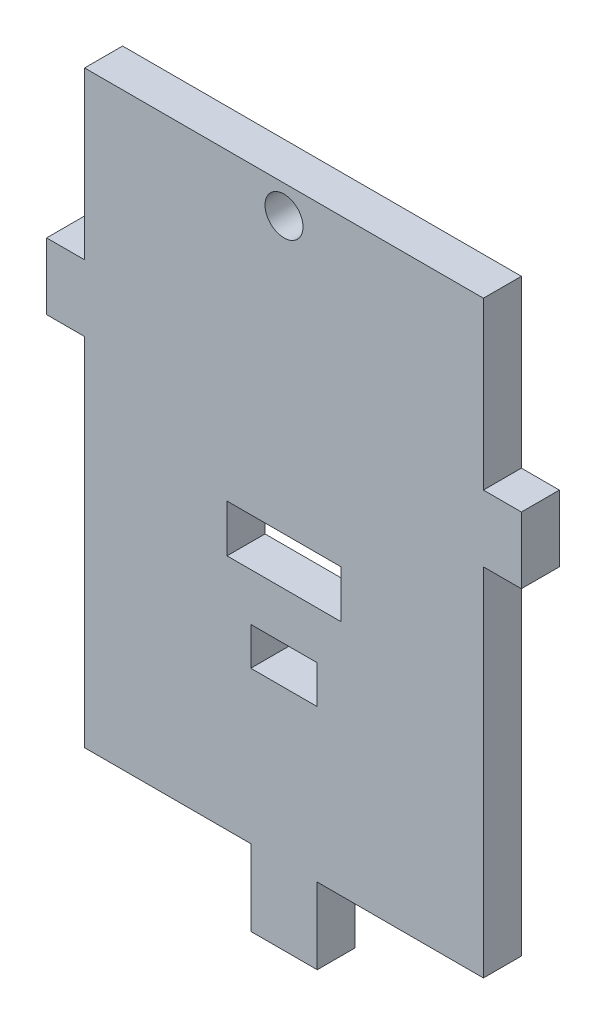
ISO-10303-21;
HEADER;
FILE_DESCRIPTION(('STEP AP214'),'2;1');
FILE_NAME('part.step','',(''),(''),'','','');
FILE_SCHEMA(('AUTOMOTIVE_DESIGN { 1 0 10303 214 1 1 1 1 }'));
ENDSEC;
DATA;
#1=APPLICATION_CONTEXT('core data for automotive mechanical design processes');
#2=APPLICATION_PROTOCOL_DEFINITION('international standard','automotive_design',2000,#1);
#3=PRODUCT_CONTEXT('',#1,'mechanical');
#4=PRODUCT('Part','Part','',(#3));
#5=PRODUCT_RELATED_PRODUCT_CATEGORY('part','',(#4));
#6=PRODUCT_DEFINITION_FORMATION('','',#4);
#7=PRODUCT_DEFINITION_CONTEXT('part definition',#1,'design');
#8=PRODUCT_DEFINITION('design','',#6,#7);
#9=PRODUCT_DEFINITION_SHAPE('','',#8);
#10=(LENGTH_UNIT() NAMED_UNIT(*) SI_UNIT(.MILLI.,.METRE.));
#11=(NAMED_UNIT(*) PLANE_ANGLE_UNIT() SI_UNIT($,.RADIAN.));
#12=(NAMED_UNIT(*) SI_UNIT($,.STERADIAN.) SOLID_ANGLE_UNIT());
#13=UNCERTAINTY_MEASURE_WITH_UNIT(LENGTH_MEASURE(1.E-05),#10,'distance_accuracy_value','');
#14=(GEOMETRIC_REPRESENTATION_CONTEXT(3) GLOBAL_UNCERTAINTY_ASSIGNED_CONTEXT((#13)) GLOBAL_UNIT_ASSIGNED_CONTEXT((#10,
#11,#12)) REPRESENTATION_CONTEXT('',''));
#15=CARTESIAN_POINT('',(0.,0.,0.));
#16=DIRECTION('',(0.,0.,1.));
#17=DIRECTION('',(1.,0.,0.));
#18=AXIS2_PLACEMENT_3D('',#15,#16,#17);
#19=CARTESIAN_POINT('',(0.,-63.3647060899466,4.));
#20=DIRECTION('',(0.,1.,0.));
#21=DIRECTION('',(0.,0.,1.));
#22=AXIS2_PLACEMENT_3D('',#19,#20,#21);
#23=PLANE('',#22);
#24=DIRECTION('',(1.,0.,0.));
#25=VECTOR('',#24,1.);
#26=CARTESIAN_POINT('',(0.,-63.3647060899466,0.));
#27=LINE('',#26,#25);
#28=CARTESIAN_POINT('',(-2.04888623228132,-63.3647060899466,0.));
#29=VERTEX_POINT('',#28);
#30=CARTESIAN_POINT('',(4.95111376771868,-63.3647060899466,0.));
#31=VERTEX_POINT('',#30);
#32=EDGE_CURVE('E289',#29,#31,#27,.T.);
#33=ORIENTED_EDGE('',*,*,#32,.T.);
#34=DIRECTION('',(0.,0.,-1.));
#35=VECTOR('',#34,1.);
#36=CARTESIAN_POINT('',(4.95111376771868,-63.3647060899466,4.));
#37=LINE('',#36,#35);
#38=CARTESIAN_POINT('',(4.95111376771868,-63.3647060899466,4.));
#39=VERTEX_POINT('',#38);
#40=EDGE_CURVE('E293',#39,#31,#37,.T.);
#41=ORIENTED_EDGE('',*,*,#40,.F.);
#42=DIRECTION('',(1.,0.,0.));
#43=VECTOR('',#42,1.);
#44=CARTESIAN_POINT('',(0.,-63.3647060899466,4.));
#45=LINE('',#44,#43);
#46=CARTESIAN_POINT('',(-2.04888623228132,-63.3647060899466,4.));
#47=VERTEX_POINT('',#46);
#48=EDGE_CURVE('E236',#47,#39,#45,.T.);
#49=ORIENTED_EDGE('',*,*,#48,.F.);
#50=DIRECTION('',(0.,0.,-1.));
#51=VECTOR('',#50,1.);
#52=CARTESIAN_POINT('',(-2.04888623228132,-63.3647060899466,4.));
#53=LINE('',#52,#51);
#54=EDGE_CURVE('E296',#47,#29,#53,.T.);
#55=ORIENTED_EDGE('',*,*,#54,.T.);
#56=EDGE_LOOP('',(#33,#41,#49,#55));
#57=FACE_BOUND('',#56,.T.);
#58=ADVANCED_FACE('F106',(#57),#23,.F.);
#59=CARTESIAN_POINT('',(-2.04888623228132,0.,4.));
#60=DIRECTION('',(1.,0.,0.));
#61=DIRECTION('',(0.,0.,-1.));
#62=AXIS2_PLACEMENT_3D('',#59,#60,#61);
#63=PLANE('',#62);
#64=DIRECTION('',(0.,-1.,0.));
#65=VECTOR('',#64,1.);
#66=CARTESIAN_POINT('',(-2.04888623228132,0.,0.));
#67=LINE('',#66,#65);
#68=CARTESIAN_POINT('',(-2.04888623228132,-55.3647060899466,0.));
#69=VERTEX_POINT('',#68);
#70=EDGE_CURVE('E286',#69,#29,#67,.T.);
#71=ORIENTED_EDGE('',*,*,#70,.T.);
#72=ORIENTED_EDGE('',*,*,#54,.F.);
#73=DIRECTION('',(0.,-1.,0.));
#74=VECTOR('',#73,1.);
#75=CARTESIAN_POINT('',(-2.04888623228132,0.,4.));
#76=LINE('',#75,#74);
#77=CARTESIAN_POINT('',(-2.04888623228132,-55.3647060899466,4.));
#78=VERTEX_POINT('',#77);
#79=EDGE_CURVE('E233',#78,#47,#76,.T.);
#80=ORIENTED_EDGE('',*,*,#79,.F.);
#81=DIRECTION('',(0.,0.,-1.));
#82=VECTOR('',#81,1.);
#83=CARTESIAN_POINT('',(-2.04888623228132,-55.3647060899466,4.));
#84=LINE('',#83,#82);
#85=EDGE_CURVE('E300',#78,#69,#84,.T.);
#86=ORIENTED_EDGE('',*,*,#85,.T.);
#87=EDGE_LOOP('',(#71,#72,#80,#86));
#88=FACE_BOUND('',#87,.T.);
#89=ADVANCED_FACE('F456',(#88),#63,.F.);
#90=CARTESIAN_POINT('',(4.95111376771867,0.,4.));
#91=DIRECTION('',(1.,0.,0.));
#92=DIRECTION('',(0.,1.,0.));
#93=AXIS2_PLACEMENT_3D('',#90,#91,#92);
#94=PLANE('',#93);
#95=DIRECTION('',(0.,-1.,0.));
#96=VECTOR('',#95,1.);
#97=CARTESIAN_POINT('',(4.95111376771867,0.,0.));
#98=LINE('',#97,#96);
#99=CARTESIAN_POINT('',(4.95111376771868,-55.3647060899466,0.));
#100=VERTEX_POINT('',#99);
#101=EDGE_CURVE('E268',#100,#31,#98,.T.);
#102=ORIENTED_EDGE('',*,*,#101,.F.);
#103=DIRECTION('',(0.,0.,-1.));
#104=VECTOR('',#103,1.);
#105=CARTESIAN_POINT('',(4.95111376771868,-55.3647060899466,4.));
#106=LINE('',#105,#104);
#107=CARTESIAN_POINT('',(4.95111376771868,-55.3647060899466,4.));
#108=VERTEX_POINT('',#107);
#109=EDGE_CURVE('E199',#108,#100,#106,.T.);
#110=ORIENTED_EDGE('',*,*,#109,.F.);
#111=DIRECTION('',(0.,-1.,0.));
#112=VECTOR('',#111,1.);
#113=CARTESIAN_POINT('',(4.95111376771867,0.,4.));
#114=LINE('',#113,#112);
#115=EDGE_CURVE('E220',#108,#39,#114,.T.);
#116=ORIENTED_EDGE('',*,*,#115,.T.);
#117=ORIENTED_EDGE('',*,*,#40,.T.);
#118=EDGE_LOOP('',(#102,#110,#116,#117));
#119=FACE_BOUND('',#118,.T.);
#120=ADVANCED_FACE('F462',(#119),#94,.T.);
#121=CARTESIAN_POINT('',(-2.04888623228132,0.,4.));
#122=DIRECTION('',(1.,0.,0.));
#123=DIRECTION('',(0.,0.,-1.));
#124=AXIS2_PLACEMENT_3D('',#121,#122,#123);
#125=PLANE('',#124);
#126=DIRECTION('',(0.,-1.,0.));
#127=VECTOR('',#126,1.);
#128=CARTESIAN_POINT('',(-2.04888623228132,0.,0.));
#129=LINE('',#128,#127);
#130=CARTESIAN_POINT('',(-2.04888623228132,-35.3647060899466,0.));
#131=VERTEX_POINT('',#130);
#132=CARTESIAN_POINT('',(-2.04888623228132,-39.3647060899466,0.));
#133=VERTEX_POINT('',#132);
#134=EDGE_CURVE('E265',#131,#133,#129,.T.);
#135=ORIENTED_EDGE('',*,*,#134,.F.);
#136=DIRECTION('',(0.,0.,-1.));
#137=VECTOR('',#136,1.);
#138=CARTESIAN_POINT('',(-2.04888623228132,-35.3647060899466,4.));
#139=LINE('',#138,#137);
#140=CARTESIAN_POINT('',(-2.04888623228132,-35.3647060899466,4.));
#141=VERTEX_POINT('',#140);
#142=EDGE_CURVE('E316',#141,#131,#139,.T.);
#143=ORIENTED_EDGE('',*,*,#142,.F.);
#144=DIRECTION('',(0.,-1.,0.));
#145=VECTOR('',#144,1.);
#146=CARTESIAN_POINT('',(-2.04888623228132,0.,4.));
#147=LINE('',#146,#145);
#148=CARTESIAN_POINT('',(-2.04888623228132,-39.3647060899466,4.));
#149=VERTEX_POINT('',#148);
#150=EDGE_CURVE('E706',#141,#149,#147,.T.);
#151=ORIENTED_EDGE('',*,*,#150,.T.);
#152=DIRECTION('',(0.,0.,-1.));
#153=VECTOR('',#152,1.);
#154=CARTESIAN_POINT('',(-2.04888623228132,-39.3647060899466,4.));
#155=LINE('',#154,#153);
#156=EDGE_CURVE('E319',#149,#133,#155,.T.);
#157=ORIENTED_EDGE('',*,*,#156,.T.);
#158=EDGE_LOOP('',(#135,#143,#151,#157));
#159=FACE_BOUND('',#158,.T.);
#160=ADVANCED_FACE('F488',(#159),#125,.T.);
#161=CARTESIAN_POINT('',(0.,-39.3647060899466,4.));
#162=DIRECTION('',(0.,1.,0.));
#163=DIRECTION('',(0.,0.,1.));
#164=AXIS2_PLACEMENT_3D('',#161,#162,#163);
#165=PLANE('',#164);
#166=DIRECTION('',(1.,0.,0.));
#167=VECTOR('',#166,1.);
#168=CARTESIAN_POINT('',(0.,-39.3647060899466,0.));
#169=LINE('',#168,#167);
#170=CARTESIAN_POINT('',(4.95111376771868,-39.3647060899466,0.));
#171=VERTEX_POINT('',#170);
#172=EDGE_CURVE('E262',#133,#171,#169,.T.);
#173=ORIENTED_EDGE('',*,*,#172,.F.);
#174=ORIENTED_EDGE('',*,*,#156,.F.);
#175=DIRECTION('',(1.,0.,0.));
#176=VECTOR('',#175,1.);
#177=CARTESIAN_POINT('',(0.,-39.3647060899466,4.));
#178=LINE('',#177,#176);
#179=CARTESIAN_POINT('',(4.95111376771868,-39.3647060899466,4.));
#180=VERTEX_POINT('',#179);
#181=EDGE_CURVE('E711',#149,#180,#178,.T.);
#182=ORIENTED_EDGE('',*,*,#181,.T.);
#183=DIRECTION('',(0.,0.,-1.));
#184=VECTOR('',#183,1.);
#185=CARTESIAN_POINT('',(4.95111376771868,-39.3647060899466,4.));
#186=LINE('',#185,#184);
#187=EDGE_CURVE('E323',#180,#171,#186,.T.);
#188=ORIENTED_EDGE('',*,*,#187,.T.);
#189=EDGE_LOOP('',(#173,#174,#182,#188));
#190=FACE_BOUND('',#189,.T.);
#191=ADVANCED_FACE('F492',(#190),#165,.T.);
#192=CARTESIAN_POINT('',(4.95111376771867,0.,4.));
#193=DIRECTION('',(1.,0.,0.));
#194=DIRECTION('',(0.,1.,0.));
#195=AXIS2_PLACEMENT_3D('',#192,#193,#194);
#196=PLANE('',#195);
#197=DIRECTION('',(0.,-1.,0.));
#198=VECTOR('',#197,1.);
#199=CARTESIAN_POINT('',(4.95111376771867,0.,0.));
#200=LINE('',#199,#198);
#201=CARTESIAN_POINT('',(4.95111376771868,-35.3647060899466,0.));
#202=VERTEX_POINT('',#201);
#203=EDGE_CURVE('E259',#202,#171,#200,.T.);
#204=ORIENTED_EDGE('',*,*,#203,.T.);
#205=ORIENTED_EDGE('',*,*,#187,.F.);
#206=DIRECTION('',(0.,-1.,0.));
#207=VECTOR('',#206,1.);
#208=CARTESIAN_POINT('',(4.95111376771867,0.,4.));
#209=LINE('',#208,#207);
#210=CARTESIAN_POINT('',(4.95111376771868,-35.3647060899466,4.));
#211=VERTEX_POINT('',#210);
#212=EDGE_CURVE('E715',#211,#180,#209,.T.);
#213=ORIENTED_EDGE('',*,*,#212,.F.);
#214=DIRECTION('',(0.,0.,-1.));
#215=VECTOR('',#214,1.);
#216=CARTESIAN_POINT('',(4.95111376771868,-35.3647060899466,4.));
#217=LINE('',#216,#215);
#218=EDGE_CURVE('E297',#211,#202,#217,.T.);
#219=ORIENTED_EDGE('',*,*,#218,.T.);
#220=EDGE_LOOP('',(#204,#205,#213,#219));
#221=FACE_BOUND('',#220,.T.);
#222=ADVANCED_FACE('F496',(#221),#196,.F.);
#223=CARTESIAN_POINT('',(0.,-35.3647060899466,4.));
#224=DIRECTION('',(0.,1.,0.));
#225=DIRECTION('',(0.,0.,1.));
#226=AXIS2_PLACEMENT_3D('',#223,#224,#225);
#227=PLANE('',#226);
#228=DIRECTION('',(1.,0.,0.));
#229=VECTOR('',#228,1.);
#230=CARTESIAN_POINT('',(0.,-35.3647060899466,0.));
#231=LINE('',#230,#229);
#232=EDGE_CURVE('E256',#131,#202,#231,.T.);
#233=ORIENTED_EDGE('',*,*,#232,.T.);
#234=ORIENTED_EDGE('',*,*,#218,.F.);
#235=DIRECTION('',(1.,0.,0.));
#236=VECTOR('',#235,1.);
#237=CARTESIAN_POINT('',(0.,-35.3647060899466,4.));
#238=LINE('',#237,#236);
#239=EDGE_CURVE('E717',#141,#211,#238,.T.);
#240=ORIENTED_EDGE('',*,*,#239,.F.);
#241=ORIENTED_EDGE('',*,*,#142,.T.);
#242=EDGE_LOOP('',(#233,#234,#240,#241));
#243=FACE_BOUND('',#242,.T.);
#244=ADVANCED_FACE('F500',(#243),#227,.F.);
#245=CARTESIAN_POINT('',(-4.54888623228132,0.,4.));
#246=DIRECTION('',(1.,0.,0.));
#247=DIRECTION('',(0.,0.,-1.));
#248=AXIS2_PLACEMENT_3D('',#245,#246,#247);
#249=PLANE('',#248);
#250=DIRECTION('',(0.,-1.,0.));
#251=VECTOR('',#250,1.);
#252=CARTESIAN_POINT('',(-4.54888623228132,0.,0.));
#253=LINE('',#252,#251);
#254=CARTESIAN_POINT('',(-4.54888623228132,-25.3647060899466,0.));
#255=VERTEX_POINT('',#254);
#256=CARTESIAN_POINT('',(-4.54888623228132,-30.3647060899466,0.));
#257=VERTEX_POINT('',#256);
#258=EDGE_CURVE('E253',#255,#257,#253,.T.);
#259=ORIENTED_EDGE('',*,*,#258,.F.);
#260=DIRECTION('',(0.,0.,-1.));
#261=VECTOR('',#260,1.);
#262=CARTESIAN_POINT('',(-4.54888623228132,-25.3647060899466,4.));
#263=LINE('',#262,#261);
#264=CARTESIAN_POINT('',(-4.54888623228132,-25.3647060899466,4.));
#265=VERTEX_POINT('',#264);
#266=EDGE_CURVE('E239',#265,#255,#263,.T.);
#267=ORIENTED_EDGE('',*,*,#266,.F.);
#268=DIRECTION('',(0.,-1.,0.));
#269=VECTOR('',#268,1.);
#270=CARTESIAN_POINT('',(-4.54888623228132,0.,4.));
#271=LINE('',#270,#269);
#272=CARTESIAN_POINT('',(-4.54888623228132,-30.3647060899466,4.));
#273=VERTEX_POINT('',#272);
#274=EDGE_CURVE('E739',#265,#273,#271,.T.);
#275=ORIENTED_EDGE('',*,*,#274,.T.);
#276=DIRECTION('',(0.,0.,-1.));
#277=VECTOR('',#276,1.);
#278=CARTESIAN_POINT('',(-4.54888623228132,-30.3647060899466,4.));
#279=LINE('',#278,#277);
#280=EDGE_CURVE('E330',#273,#257,#279,.T.);
#281=ORIENTED_EDGE('',*,*,#280,.T.);
#282=EDGE_LOOP('',(#259,#267,#275,#281));
#283=FACE_BOUND('',#282,.T.);
#284=ADVANCED_FACE('F504',(#283),#249,.T.);
#285=CARTESIAN_POINT('',(0.,-30.3647060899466,4.));
#286=DIRECTION('',(0.,1.,0.));
#287=DIRECTION('',(0.,0.,1.));
#288=AXIS2_PLACEMENT_3D('',#285,#286,#287);
#289=PLANE('',#288);
#290=DIRECTION('',(1.,0.,0.));
#291=VECTOR('',#290,1.);
#292=CARTESIAN_POINT('',(0.,-30.3647060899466,0.));
#293=LINE('',#292,#291);
#294=CARTESIAN_POINT('',(7.45111376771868,-30.3647060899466,0.));
#295=VERTEX_POINT('',#294);
#296=EDGE_CURVE('E250',#257,#295,#293,.T.);
#297=ORIENTED_EDGE('',*,*,#296,.F.);
#298=ORIENTED_EDGE('',*,*,#280,.F.);
#299=DIRECTION('',(1.,0.,0.));
#300=VECTOR('',#299,1.);
#301=CARTESIAN_POINT('',(0.,-30.3647060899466,4.));
#302=LINE('',#301,#300);
#303=CARTESIAN_POINT('',(7.45111376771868,-30.3647060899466,4.));
#304=VERTEX_POINT('',#303);
#305=EDGE_CURVE('E742',#273,#304,#302,.T.);
#306=ORIENTED_EDGE('',*,*,#305,.T.);
#307=DIRECTION('',(0.,0.,-1.));
#308=VECTOR('',#307,1.);
#309=CARTESIAN_POINT('',(7.45111376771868,-30.3647060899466,4.));
#310=LINE('',#309,#308);
#311=EDGE_CURVE('E333',#304,#295,#310,.T.);
#312=ORIENTED_EDGE('',*,*,#311,.T.);
#313=EDGE_LOOP('',(#297,#298,#306,#312));
#314=FACE_BOUND('',#313,.T.);
#315=ADVANCED_FACE('F508',(#314),#289,.T.);
#316=CARTESIAN_POINT('',(7.45111376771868,0.,4.));
#317=DIRECTION('',(1.,0.,0.));
#318=DIRECTION('',(0.,0.,-1.));
#319=AXIS2_PLACEMENT_3D('',#316,#317,#318);
#320=PLANE('',#319);
#321=DIRECTION('',(0.,-1.,0.));
#322=VECTOR('',#321,1.);
#323=CARTESIAN_POINT('',(7.45111376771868,0.,0.));
#324=LINE('',#323,#322);
#325=CARTESIAN_POINT('',(7.45111376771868,-25.3647060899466,0.));
#326=VERTEX_POINT('',#325);
#327=EDGE_CURVE('E247',#326,#295,#324,.T.);
#328=ORIENTED_EDGE('',*,*,#327,.T.);
#329=ORIENTED_EDGE('',*,*,#311,.F.);
#330=DIRECTION('',(0.,-1.,0.));
#331=VECTOR('',#330,1.);
#332=CARTESIAN_POINT('',(7.45111376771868,0.,4.));
#333=LINE('',#332,#331);
#334=CARTESIAN_POINT('',(7.45111376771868,-25.3647060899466,4.));
#335=VERTEX_POINT('',#334);
#336=EDGE_CURVE('E745',#335,#304,#333,.T.);
#337=ORIENTED_EDGE('',*,*,#336,.F.);
#338=DIRECTION('',(0.,0.,-1.));
#339=VECTOR('',#338,1.);
#340=CARTESIAN_POINT('',(7.45111376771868,-25.3647060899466,4.));
#341=LINE('',#340,#339);
#342=EDGE_CURVE('E320',#335,#326,#341,.T.);
#343=ORIENTED_EDGE('',*,*,#342,.T.);
#344=EDGE_LOOP('',(#328,#329,#337,#343));
#345=FACE_BOUND('',#344,.T.);
#346=ADVANCED_FACE('F512',(#345),#320,.F.);
#347=CARTESIAN_POINT('',(0.,-25.3647060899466,4.));
#348=DIRECTION('',(0.,1.,0.));
#349=DIRECTION('',(0.,0.,1.));
#350=AXIS2_PLACEMENT_3D('',#347,#348,#349);
#351=PLANE('',#350);
#352=DIRECTION('',(1.,0.,0.));
#353=VECTOR('',#352,1.);
#354=CARTESIAN_POINT('',(0.,-25.3647060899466,0.));
#355=LINE('',#354,#353);
#356=EDGE_CURVE('E243',#255,#326,#355,.T.);
#357=ORIENTED_EDGE('',*,*,#356,.T.);
#358=ORIENTED_EDGE('',*,*,#342,.F.);
#359=DIRECTION('',(1.,0.,0.));
#360=VECTOR('',#359,1.);
#361=CARTESIAN_POINT('',(0.,-25.3647060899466,4.));
#362=LINE('',#361,#360);
#363=EDGE_CURVE('E748',#265,#335,#362,.T.);
#364=ORIENTED_EDGE('',*,*,#363,.F.);
#365=ORIENTED_EDGE('',*,*,#266,.T.);
#366=EDGE_LOOP('',(#357,#358,#364,#365));
#367=FACE_BOUND('',#366,.T.);
#368=ADVANCED_FACE('F482',(#367),#351,.F.);
#369=CARTESIAN_POINT('',(1.45111376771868,3.63529391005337,4.));
#370=DIRECTION('',(0.,0.,-1.));
#371=DIRECTION('',(-1.,0.,0.));
#372=AXIS2_PLACEMENT_3D('',#369,#370,#371);
#373=CYLINDRICAL_SURFACE('',#372,2.);
#374=CARTESIAN_POINT('',(1.45111376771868,3.63529391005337,4.));
#375=DIRECTION('',(0.,0.,1.));
#376=DIRECTION('',(1.,0.,0.));
#377=AXIS2_PLACEMENT_3D('',#374,#375,#376);
#378=CIRCLE('',#377,2.);
#379=CARTESIAN_POINT('',(3.45111376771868,3.63529391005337,4.));
#380=VERTEX_POINT('',#379);
#381=EDGE_CURVE('E292',#380,#380,#378,.T.);
#382=ORIENTED_EDGE('',*,*,#381,.T.);
#383=EDGE_LOOP('',(#382));
#384=FACE_BOUND('',#383,.T.);
#385=CARTESIAN_POINT('',(1.45111376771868,3.63529391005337,0.));
#386=DIRECTION('',(0.,0.,1.));
#387=DIRECTION('',(1.,0.,0.));
#388=AXIS2_PLACEMENT_3D('',#385,#386,#387);
#389=CIRCLE('',#388,2.);
#390=CARTESIAN_POINT('',(3.45111376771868,3.63529391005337,0.));
#391=VERTEX_POINT('',#390);
#392=EDGE_CURVE('E240',#391,#391,#389,.T.);
#393=ORIENTED_EDGE('',*,*,#392,.F.);
#394=EDGE_LOOP('',(#393));
#395=FACE_BOUND('',#394,.T.);
#396=ADVANCED_FACE('F477',(#384,#395),#373,.F.);
#397=CARTESIAN_POINT('',(0.,-55.3647060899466,4.));
#398=DIRECTION('',(0.,1.,0.));
#399=DIRECTION('',(0.,0.,1.));
#400=AXIS2_PLACEMENT_3D('',#397,#398,#399);
#401=PLANE('',#400);
#402=DIRECTION('',(1.,0.,0.));
#403=VECTOR('',#402,1.);
#404=CARTESIAN_POINT('',(0.,-55.3647060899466,0.));
#405=LINE('',#404,#403);
#406=CARTESIAN_POINT('',(22.4511137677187,-55.3647060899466,0.));
#407=VERTEX_POINT('',#406);
#408=EDGE_CURVE('E270',#100,#407,#405,.T.);
#409=ORIENTED_EDGE('',*,*,#408,.T.);
#410=DIRECTION('',(0.,0.,-1.));
#411=VECTOR('',#410,1.);
#412=CARTESIAN_POINT('',(22.4511137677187,-55.3647060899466,4.));
#413=LINE('',#412,#411);
#414=CARTESIAN_POINT('',(22.4511137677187,-55.3647060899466,4.));
#415=VERTEX_POINT('',#414);
#416=EDGE_CURVE('E312',#415,#407,#413,.T.);
#417=ORIENTED_EDGE('',*,*,#416,.F.);
#418=DIRECTION('',(1.,0.,0.));
#419=VECTOR('',#418,1.);
#420=CARTESIAN_POINT('',(0.,-55.3647060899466,4.));
#421=LINE('',#420,#419);
#422=EDGE_CURVE('E214',#108,#415,#421,.T.);
#423=ORIENTED_EDGE('',*,*,#422,.F.);
#424=ORIENTED_EDGE('',*,*,#109,.T.);
#425=EDGE_LOOP('',(#409,#417,#423,#424));
#426=FACE_BOUND('',#425,.T.);
#427=ADVANCED_FACE('F473',(#426),#401,.F.);
#428=CARTESIAN_POINT('',(0.,6.63529391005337,4.));
#429=DIRECTION('',(0.,1.,0.));
#430=DIRECTION('',(0.,0.,1.));
#431=AXIS2_PLACEMENT_3D('',#428,#429,#430);
#432=PLANE('',#431);
#433=DIRECTION('',(1.,0.,0.));
#434=VECTOR('',#433,1.);
#435=CARTESIAN_POINT('',(0.,6.63529391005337,0.));
#436=LINE('',#435,#434);
#437=CARTESIAN_POINT('',(-19.5488862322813,6.63529391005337,0.));
#438=VERTEX_POINT('',#437);
#439=CARTESIAN_POINT('',(22.4511137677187,6.63529391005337,0.));
#440=VERTEX_POINT('',#439);
#441=EDGE_CURVE('E276',#438,#440,#436,.T.);
#442=ORIENTED_EDGE('',*,*,#441,.F.);
#443=DIRECTION('',(0.,0.,-1.));
#444=VECTOR('',#443,1.);
#445=CARTESIAN_POINT('',(-19.5488862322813,6.63529391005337,4.));
#446=LINE('',#445,#444);
#447=CARTESIAN_POINT('',(-19.5488862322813,6.63529391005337,4.));
#448=VERTEX_POINT('',#447);
#449=EDGE_CURVE('E306',#448,#438,#446,.T.);
#450=ORIENTED_EDGE('',*,*,#449,.F.);
#451=DIRECTION('',(1.,0.,0.));
#452=VECTOR('',#451,1.);
#453=CARTESIAN_POINT('',(0.,6.63529391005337,4.));
#454=LINE('',#453,#452);
#455=CARTESIAN_POINT('',(22.4511137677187,6.63529391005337,4.));
#456=VERTEX_POINT('',#455);
#457=EDGE_CURVE('E219',#448,#456,#454,.T.);
#458=ORIENTED_EDGE('',*,*,#457,.T.);
#459=DIRECTION('',(0.,0.,-1.));
#460=VECTOR('',#459,1.);
#461=CARTESIAN_POINT('',(22.4511137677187,6.63529391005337,4.));
#462=LINE('',#461,#460);
#463=EDGE_CURVE('E309',#456,#440,#462,.T.);
#464=ORIENTED_EDGE('',*,*,#463,.T.);
#465=EDGE_LOOP('',(#442,#450,#458,#464));
#466=FACE_BOUND('',#465,.T.);
#467=ADVANCED_FACE('F408',(#466),#432,.T.);
#468=CARTESIAN_POINT('',(0.,-55.3647060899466,4.));
#469=DIRECTION('',(0.,1.,0.));
#470=DIRECTION('',(0.,0.,1.));
#471=AXIS2_PLACEMENT_3D('',#468,#469,#470);
#472=PLANE('',#471);
#473=DIRECTION('',(1.,0.,0.));
#474=VECTOR('',#473,1.);
#475=CARTESIAN_POINT('',(0.,-55.3647060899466,0.));
#476=LINE('',#475,#474);
#477=CARTESIAN_POINT('',(-19.5488862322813,-55.3647060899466,0.));
#478=VERTEX_POINT('',#477);
#479=EDGE_CURVE('E283',#478,#69,#476,.T.);
#480=ORIENTED_EDGE('',*,*,#479,.T.);
#481=ORIENTED_EDGE('',*,*,#85,.F.);
#482=DIRECTION('',(1.,0.,0.));
#483=VECTOR('',#482,1.);
#484=CARTESIAN_POINT('',(0.,-55.3647060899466,4.));
#485=LINE('',#484,#483);
#486=CARTESIAN_POINT('',(-19.5488862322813,-55.3647060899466,4.));
#487=VERTEX_POINT('',#486);
#488=EDGE_CURVE('E230',#487,#78,#485,.T.);
#489=ORIENTED_EDGE('',*,*,#488,.F.);
#490=DIRECTION('',(0.,0.,-1.));
#491=VECTOR('',#490,1.);
#492=CARTESIAN_POINT('',(-19.5488862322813,-55.3647060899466,4.));
#493=LINE('',#492,#491);
#494=EDGE_CURVE('E303',#487,#478,#493,.T.);
#495=ORIENTED_EDGE('',*,*,#494,.T.);
#496=EDGE_LOOP('',(#480,#481,#489,#495));
#497=FACE_BOUND('',#496,.T.);
#498=ADVANCED_FACE('F468',(#497),#472,.F.);
#499=CARTESIAN_POINT('',(0.,0.,0.));
#500=DIRECTION('',(0.,0.,1.));
#501=DIRECTION('',(1.,0.,0.));
#502=AXIS2_PLACEMENT_3D('',#499,#500,#501);
#503=PLANE('',#502);
#504=ORIENTED_EDGE('',*,*,#392,.T.);
#505=EDGE_LOOP('',(#504));
#506=FACE_BOUND('',#505,.T.);
#507=ORIENTED_EDGE('',*,*,#356,.F.);
#508=ORIENTED_EDGE('',*,*,#258,.T.);
#509=ORIENTED_EDGE('',*,*,#296,.T.);
#510=ORIENTED_EDGE('',*,*,#327,.F.);
#511=EDGE_LOOP('',(#507,#508,#509,#510));
#512=FACE_BOUND('',#511,.T.);
#513=ORIENTED_EDGE('',*,*,#232,.F.);
#514=ORIENTED_EDGE('',*,*,#134,.T.);
#515=ORIENTED_EDGE('',*,*,#172,.T.);
#516=ORIENTED_EDGE('',*,*,#203,.F.);
#517=EDGE_LOOP('',(#513,#514,#515,#516));
#518=FACE_BOUND('',#517,.T.);
#519=ORIENTED_EDGE('',*,*,#101,.T.);
#520=ORIENTED_EDGE('',*,*,#32,.F.);
#521=ORIENTED_EDGE('',*,*,#70,.F.);
#522=ORIENTED_EDGE('',*,*,#479,.F.);
#523=DIRECTION('',(0.,-1.,0.));
#524=VECTOR('',#523,1.);
#525=CARTESIAN_POINT('',(-19.5488862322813,0.,0.));
#526=LINE('',#525,#524);
#527=CARTESIAN_POINT('',(-19.5488862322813,-17.8647060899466,0.));
#528=VERTEX_POINT('',#527);
#529=EDGE_CURVE('E279',#528,#478,#526,.T.);
#530=ORIENTED_EDGE('',*,*,#529,.F.);
#531=DIRECTION('',(1.,0.,0.));
#532=VECTOR('',#531,1.);
#533=CARTESIAN_POINT('',(-23.5488862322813,-17.8647060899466,0.));
#534=LINE('',#533,#532);
#535=CARTESIAN_POINT('',(-23.5488862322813,-17.8647060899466,0.));
#536=VERTEX_POINT('',#535);
#537=EDGE_CURVE('E348',#536,#528,#534,.T.);
#538=ORIENTED_EDGE('',*,*,#537,.F.);
#539=DIRECTION('',(0.,-1.,0.));
#540=VECTOR('',#539,1.);
#541=CARTESIAN_POINT('',(-23.5488862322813,-10.8647060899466,0.));
#542=LINE('',#541,#540);
#543=CARTESIAN_POINT('',(-23.5488862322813,-10.8647060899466,0.));
#544=VERTEX_POINT('',#543);
#545=EDGE_CURVE('E341',#544,#536,#542,.T.);
#546=ORIENTED_EDGE('',*,*,#545,.F.);
#547=DIRECTION('',(1.,0.,0.));
#548=VECTOR('',#547,1.);
#549=CARTESIAN_POINT('',(-23.5488862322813,-10.8647060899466,0.));
#550=LINE('',#549,#548);
#551=CARTESIAN_POINT('',(-19.5488862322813,-10.8647060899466,0.));
#552=VERTEX_POINT('',#551);
#553=EDGE_CURVE('E167',#544,#552,#550,.T.);
#554=ORIENTED_EDGE('',*,*,#553,.T.);
#555=EDGE_CURVE('E280',#438,#552,#526,.T.);
#556=ORIENTED_EDGE('',*,*,#555,.F.);
#557=ORIENTED_EDGE('',*,*,#441,.T.);
#558=DIRECTION('',(0.,-1.,0.));
#559=VECTOR('',#558,1.);
#560=CARTESIAN_POINT('',(22.4511137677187,0.,0.));
#561=LINE('',#560,#559);
#562=CARTESIAN_POINT('',(22.4511137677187,-10.8647060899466,0.));
#563=VERTEX_POINT('',#562);
#564=EDGE_CURVE('E274',#440,#563,#561,.T.);
#565=ORIENTED_EDGE('',*,*,#564,.T.);
#566=DIRECTION('',(1.,0.,0.));
#567=VECTOR('',#566,1.);
#568=CARTESIAN_POINT('',(22.4511137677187,-10.8647060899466,0.));
#569=LINE('',#568,#567);
#570=CARTESIAN_POINT('',(26.4511137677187,-10.8647060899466,0.));
#571=VERTEX_POINT('',#570);
#572=EDGE_CURVE('E178',#563,#571,#569,.T.);
#573=ORIENTED_EDGE('',*,*,#572,.T.);
#574=DIRECTION('',(0.,-1.,0.));
#575=VECTOR('',#574,1.);
#576=CARTESIAN_POINT('',(26.4511137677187,-10.8647060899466,0.));
#577=LINE('',#576,#575);
#578=CARTESIAN_POINT('',(26.4511137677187,-17.8647060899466,0.));
#579=VERTEX_POINT('',#578);
#580=EDGE_CURVE('E162',#571,#579,#577,.T.);
#581=ORIENTED_EDGE('',*,*,#580,.T.);
#582=DIRECTION('',(1.,0.,0.));
#583=VECTOR('',#582,1.);
#584=CARTESIAN_POINT('',(22.4511137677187,-17.8647060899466,0.));
#585=LINE('',#584,#583);
#586=CARTESIAN_POINT('',(22.4511137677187,-17.8647060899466,0.));
#587=VERTEX_POINT('',#586);
#588=EDGE_CURVE('E169',#587,#579,#585,.T.);
#589=ORIENTED_EDGE('',*,*,#588,.F.);
#590=EDGE_CURVE('E273',#587,#407,#561,.T.);
#591=ORIENTED_EDGE('',*,*,#590,.T.);
#592=ORIENTED_EDGE('',*,*,#408,.F.);
#593=EDGE_LOOP('',(#519,#520,#521,#522,#530,#538,#546,#554,#556,#557,#565,#573,#581,#589,#591,#592));
#594=FACE_BOUND('',#593,.T.);
#595=ADVANCED_FACE('F176',(#506,#512,#518,#594),#503,.F.);
#596=CARTESIAN_POINT('',(0.,0.,4.));
#597=DIRECTION('',(0.,0.,1.));
#598=DIRECTION('',(1.,0.,0.));
#599=AXIS2_PLACEMENT_3D('',#596,#597,#598);
#600=PLANE('',#599);
#601=ORIENTED_EDGE('',*,*,#381,.F.);
#602=EDGE_LOOP('',(#601));
#603=FACE_BOUND('',#602,.T.);
#604=ORIENTED_EDGE('',*,*,#363,.T.);
#605=ORIENTED_EDGE('',*,*,#336,.T.);
#606=ORIENTED_EDGE('',*,*,#305,.F.);
#607=ORIENTED_EDGE('',*,*,#274,.F.);
#608=EDGE_LOOP('',(#604,#605,#606,#607));
#609=FACE_BOUND('',#608,.T.);
#610=ORIENTED_EDGE('',*,*,#239,.T.);
#611=ORIENTED_EDGE('',*,*,#212,.T.);
#612=ORIENTED_EDGE('',*,*,#181,.F.);
#613=ORIENTED_EDGE('',*,*,#150,.F.);
#614=EDGE_LOOP('',(#610,#611,#612,#613));
#615=FACE_BOUND('',#614,.T.);
#616=ORIENTED_EDGE('',*,*,#115,.F.);
#617=ORIENTED_EDGE('',*,*,#422,.T.);
#618=DIRECTION('',(0.,-1.,0.));
#619=VECTOR('',#618,1.);
#620=CARTESIAN_POINT('',(22.4511137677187,0.,4.));
#621=LINE('',#620,#619);
#622=CARTESIAN_POINT('',(22.4511137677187,-17.8647060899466,4.));
#623=VERTEX_POINT('',#622);
#624=EDGE_CURVE('E211',#623,#415,#621,.T.);
#625=ORIENTED_EDGE('',*,*,#624,.F.);
#626=DIRECTION('',(1.,0.,0.));
#627=VECTOR('',#626,1.);
#628=CARTESIAN_POINT('',(22.4511137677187,-17.8647060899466,4.));
#629=LINE('',#628,#627);
#630=CARTESIAN_POINT('',(26.4511137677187,-17.8647060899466,4.));
#631=VERTEX_POINT('',#630);
#632=EDGE_CURVE('E204',#623,#631,#629,.T.);
#633=ORIENTED_EDGE('',*,*,#632,.T.);
#634=DIRECTION('',(0.,-1.,0.));
#635=VECTOR('',#634,1.);
#636=CARTESIAN_POINT('',(26.4511137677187,-10.8647060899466,4.));
#637=LINE('',#636,#635);
#638=CARTESIAN_POINT('',(26.4511137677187,-10.8647060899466,4.));
#639=VERTEX_POINT('',#638);
#640=EDGE_CURVE('E165',#639,#631,#637,.T.);
#641=ORIENTED_EDGE('',*,*,#640,.F.);
#642=DIRECTION('',(1.,0.,0.));
#643=VECTOR('',#642,1.);
#644=CARTESIAN_POINT('',(22.4511137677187,-10.8647060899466,4.));
#645=LINE('',#644,#643);
#646=CARTESIAN_POINT('',(22.4511137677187,-10.8647060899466,4.));
#647=VERTEX_POINT('',#646);
#648=EDGE_CURVE('E173',#647,#639,#645,.T.);
#649=ORIENTED_EDGE('',*,*,#648,.F.);
#650=EDGE_CURVE('E217',#456,#647,#621,.T.);
#651=ORIENTED_EDGE('',*,*,#650,.F.);
#652=ORIENTED_EDGE('',*,*,#457,.F.);
#653=DIRECTION('',(0.,-1.,0.));
#654=VECTOR('',#653,1.);
#655=CARTESIAN_POINT('',(-19.5488862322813,0.,4.));
#656=LINE('',#655,#654);
#657=CARTESIAN_POINT('',(-19.5488862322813,-10.8647060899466,4.));
#658=VERTEX_POINT('',#657);
#659=EDGE_CURVE('E227',#448,#658,#656,.T.);
#660=ORIENTED_EDGE('',*,*,#659,.T.);
#661=DIRECTION('',(1.,0.,0.));
#662=VECTOR('',#661,1.);
#663=CARTESIAN_POINT('',(-23.5488862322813,-10.8647060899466,4.));
#664=LINE('',#663,#662);
#665=CARTESIAN_POINT('',(-23.5488862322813,-10.8647060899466,4.));
#666=VERTEX_POINT('',#665);
#667=EDGE_CURVE('E338',#666,#658,#664,.T.);
#668=ORIENTED_EDGE('',*,*,#667,.F.);
#669=DIRECTION('',(0.,-1.,0.));
#670=VECTOR('',#669,1.);
#671=CARTESIAN_POINT('',(-23.5488862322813,-10.8647060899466,4.));
#672=LINE('',#671,#670);
#673=CARTESIAN_POINT('',(-23.5488862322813,-17.8647060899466,4.));
#674=VERTEX_POINT('',#673);
#675=EDGE_CURVE('E344',#666,#674,#672,.T.);
#676=ORIENTED_EDGE('',*,*,#675,.T.);
#677=DIRECTION('',(1.,0.,0.));
#678=VECTOR('',#677,1.);
#679=CARTESIAN_POINT('',(-23.5488862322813,-17.8647060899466,4.));
#680=LINE('',#679,#678);
#681=CARTESIAN_POINT('',(-19.5488862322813,-17.8647060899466,4.));
#682=VERTEX_POINT('',#681);
#683=EDGE_CURVE('E340',#674,#682,#680,.T.);
#684=ORIENTED_EDGE('',*,*,#683,.T.);
#685=EDGE_CURVE('E226',#682,#487,#656,.T.);
#686=ORIENTED_EDGE('',*,*,#685,.T.);
#687=ORIENTED_EDGE('',*,*,#488,.T.);
#688=ORIENTED_EDGE('',*,*,#79,.T.);
#689=ORIENTED_EDGE('',*,*,#48,.T.);
#690=EDGE_LOOP('',(#616,#617,#625,#633,#641,#649,#651,#652,#660,#668,#676,#684,#686,#687,#688,#689));
#691=FACE_BOUND('',#690,.T.);
#692=ADVANCED_FACE('F208',(#603,#609,#615,#691),#600,.T.);
#693=CARTESIAN_POINT('',(-19.5488862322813,0.,4.));
#694=DIRECTION('',(1.,0.,0.));
#695=DIRECTION('',(0.,1.,0.));
#696=AXIS2_PLACEMENT_3D('',#693,#694,#695);
#697=PLANE('',#696);
#698=ORIENTED_EDGE('',*,*,#685,.F.);
#699=DIRECTION('',(0.,0.,-1.));
#700=VECTOR('',#699,1.);
#701=CARTESIAN_POINT('',(-19.5488862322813,-17.8647060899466,4.));
#702=LINE('',#701,#700);
#703=EDGE_CURVE('E190',#682,#528,#702,.T.);
#704=ORIENTED_EDGE('',*,*,#703,.T.);
#705=ORIENTED_EDGE('',*,*,#529,.T.);
#706=ORIENTED_EDGE('',*,*,#494,.F.);
#707=EDGE_LOOP('',(#698,#704,#705,#706));
#708=FACE_BOUND('',#707,.T.);
#709=ADVANCED_FACE('F373',(#708),#697,.F.);
#710=DIRECTION('',(0.,0.,-1.));
#711=VECTOR('',#710,1.);
#712=CARTESIAN_POINT('',(-19.5488862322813,-10.8647060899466,4.));
#713=LINE('',#712,#711);
#714=EDGE_CURVE('E184',#658,#552,#713,.T.);
#715=ORIENTED_EDGE('',*,*,#714,.F.);
#716=ORIENTED_EDGE('',*,*,#659,.F.);
#717=ORIENTED_EDGE('',*,*,#449,.T.);
#718=ORIENTED_EDGE('',*,*,#555,.T.);
#719=EDGE_LOOP('',(#715,#716,#717,#718));
#720=FACE_BOUND('',#719,.T.);
#721=ADVANCED_FACE('F402',(#720),#697,.F.);
#722=CARTESIAN_POINT('',(22.4511137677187,0.,4.));
#723=DIRECTION('',(1.,0.,0.));
#724=DIRECTION('',(0.,1.,0.));
#725=AXIS2_PLACEMENT_3D('',#722,#723,#724);
#726=PLANE('',#725);
#727=ORIENTED_EDGE('',*,*,#650,.T.);
#728=DIRECTION('',(0.,0.,-1.));
#729=VECTOR('',#728,1.);
#730=CARTESIAN_POINT('',(22.4511137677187,-10.8647060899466,4.));
#731=LINE('',#730,#729);
#732=EDGE_CURVE('E116',#647,#563,#731,.T.);
#733=ORIENTED_EDGE('',*,*,#732,.T.);
#734=ORIENTED_EDGE('',*,*,#564,.F.);
#735=ORIENTED_EDGE('',*,*,#463,.F.);
#736=EDGE_LOOP('',(#727,#733,#734,#735));
#737=FACE_BOUND('',#736,.T.);
#738=ADVANCED_FACE('F444',(#737),#726,.T.);
#739=DIRECTION('',(0.,0.,-1.));
#740=VECTOR('',#739,1.);
#741=CARTESIAN_POINT('',(22.4511137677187,-17.8647060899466,4.));
#742=LINE('',#741,#740);
#743=EDGE_CURVE('E12',#623,#587,#742,.T.);
#744=ORIENTED_EDGE('',*,*,#743,.F.);
#745=ORIENTED_EDGE('',*,*,#624,.T.);
#746=ORIENTED_EDGE('',*,*,#416,.T.);
#747=ORIENTED_EDGE('',*,*,#590,.F.);
#748=EDGE_LOOP('',(#744,#745,#746,#747));
#749=FACE_BOUND('',#748,.T.);
#750=ADVANCED_FACE('F446',(#749),#726,.T.);
#751=CARTESIAN_POINT('',(-23.5488862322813,-10.8647060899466,4.));
#752=DIRECTION('',(1.,0.,0.));
#753=DIRECTION('',(0.,0.,-1.));
#754=AXIS2_PLACEMENT_3D('',#751,#752,#753);
#755=PLANE('',#754);
#756=ORIENTED_EDGE('',*,*,#545,.T.);
#757=DIRECTION('',(0.,0.,-1.));
#758=VECTOR('',#757,1.);
#759=CARTESIAN_POINT('',(-23.5488862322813,-17.8647060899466,4.));
#760=LINE('',#759,#758);
#761=EDGE_CURVE('E346',#674,#536,#760,.T.);
#762=ORIENTED_EDGE('',*,*,#761,.F.);
#763=ORIENTED_EDGE('',*,*,#675,.F.);
#764=DIRECTION('',(0.,0.,-1.));
#765=VECTOR('',#764,1.);
#766=CARTESIAN_POINT('',(-23.5488862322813,-10.8647060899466,4.));
#767=LINE('',#766,#765);
#768=EDGE_CURVE('E244',#666,#544,#767,.T.);
#769=ORIENTED_EDGE('',*,*,#768,.T.);
#770=EDGE_LOOP('',(#756,#762,#763,#769));
#771=FACE_BOUND('',#770,.T.);
#772=ADVANCED_FACE('F397',(#771),#755,.F.);
#773=CARTESIAN_POINT('',(-23.5488862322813,-17.8647060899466,4.));
#774=DIRECTION('',(0.,1.,0.));
#775=DIRECTION('',(0.,0.,1.));
#776=AXIS2_PLACEMENT_3D('',#773,#774,#775);
#777=PLANE('',#776);
#778=ORIENTED_EDGE('',*,*,#537,.T.);
#779=ORIENTED_EDGE('',*,*,#703,.F.);
#780=ORIENTED_EDGE('',*,*,#683,.F.);
#781=ORIENTED_EDGE('',*,*,#761,.T.);
#782=EDGE_LOOP('',(#778,#779,#780,#781));
#783=FACE_BOUND('',#782,.T.);
#784=ADVANCED_FACE('F357',(#783),#777,.F.);
#785=CARTESIAN_POINT('',(-23.5488862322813,-10.8647060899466,4.));
#786=DIRECTION('',(0.,1.,0.));
#787=DIRECTION('',(0.,0.,1.));
#788=AXIS2_PLACEMENT_3D('',#785,#786,#787);
#789=PLANE('',#788);
#790=ORIENTED_EDGE('',*,*,#553,.F.);
#791=ORIENTED_EDGE('',*,*,#768,.F.);
#792=ORIENTED_EDGE('',*,*,#667,.T.);
#793=ORIENTED_EDGE('',*,*,#714,.T.);
#794=EDGE_LOOP('',(#790,#791,#792,#793));
#795=FACE_BOUND('',#794,.T.);
#796=ADVANCED_FACE('F398',(#795),#789,.T.);
#797=CARTESIAN_POINT('',(26.4511137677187,-10.8647060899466,4.));
#798=DIRECTION('',(1.,0.,0.));
#799=DIRECTION('',(0.,0.,-1.));
#800=AXIS2_PLACEMENT_3D('',#797,#798,#799);
#801=PLANE('',#800);
#802=ORIENTED_EDGE('',*,*,#580,.F.);
#803=DIRECTION('',(0.,0.,-1.));
#804=VECTOR('',#803,1.);
#805=CARTESIAN_POINT('',(26.4511137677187,-10.8647060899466,4.));
#806=LINE('',#805,#804);
#807=EDGE_CURVE('E110',#639,#571,#806,.T.);
#808=ORIENTED_EDGE('',*,*,#807,.F.);
#809=ORIENTED_EDGE('',*,*,#640,.T.);
#810=DIRECTION('',(0.,0.,-1.));
#811=VECTOR('',#810,1.);
#812=CARTESIAN_POINT('',(26.4511137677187,-17.8647060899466,4.));
#813=LINE('',#812,#811);
#814=EDGE_CURVE('E158',#631,#579,#813,.T.);
#815=ORIENTED_EDGE('',*,*,#814,.T.);
#816=EDGE_LOOP('',(#802,#808,#809,#815));
#817=FACE_BOUND('',#816,.T.);
#818=ADVANCED_FACE('F160',(#817),#801,.T.);
#819=CARTESIAN_POINT('',(22.4511137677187,-10.8647060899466,4.));
#820=DIRECTION('',(0.,1.,0.));
#821=DIRECTION('',(0.,0.,1.));
#822=AXIS2_PLACEMENT_3D('',#819,#820,#821);
#823=PLANE('',#822);
#824=ORIENTED_EDGE('',*,*,#572,.F.);
#825=ORIENTED_EDGE('',*,*,#732,.F.);
#826=ORIENTED_EDGE('',*,*,#648,.T.);
#827=ORIENTED_EDGE('',*,*,#807,.T.);
#828=EDGE_LOOP('',(#824,#825,#826,#827));
#829=FACE_BOUND('',#828,.T.);
#830=ADVANCED_FACE('F108',(#829),#823,.T.);
#831=CARTESIAN_POINT('',(22.4511137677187,-17.8647060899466,4.));
#832=DIRECTION('',(0.,1.,0.));
#833=DIRECTION('',(-1.,0.,0.));
#834=AXIS2_PLACEMENT_3D('',#831,#832,#833);
#835=PLANE('',#834);
#836=ORIENTED_EDGE('',*,*,#588,.T.);
#837=ORIENTED_EDGE('',*,*,#814,.F.);
#838=ORIENTED_EDGE('',*,*,#632,.F.);
#839=ORIENTED_EDGE('',*,*,#743,.T.);
#840=EDGE_LOOP('',(#836,#837,#838,#839));
#841=FACE_BOUND('',#840,.T.);
#842=ADVANCED_FACE('F170',(#841),#835,.F.);
#843=CLOSED_SHELL('',(#58,#89,#120,#160,#191,#222,#244,#284,#315,#346,#368,#396,#427,#467,#498,
#595,#692,#709,#721,#738,#750,#772,#784,#796,#818,#830,#842));
#844=MANIFOLD_SOLID_BREP('B2',#843);
#845=ADVANCED_BREP_SHAPE_REPRESENTATION('',(#18,#844),#14);
#846=SHAPE_DEFINITION_REPRESENTATION(#9,#845);
ENDSEC;
END-ISO-10303-21;
